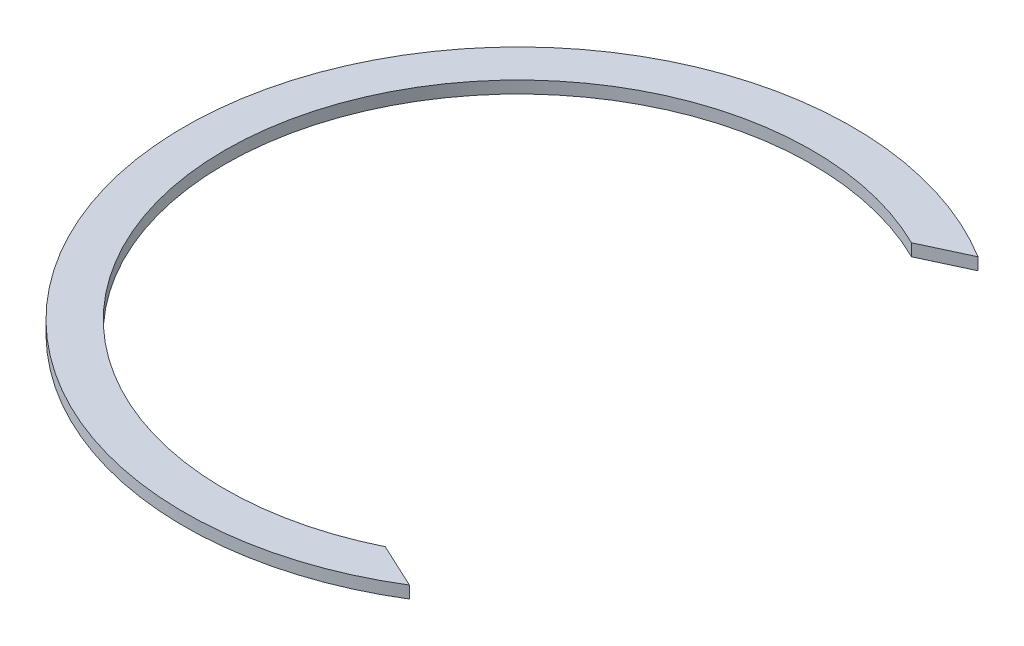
from build123d import *

# Parameters (mm, degrees)
SKETCH_1_R           = 16.5
SKETCH_1_R_2         = 14
EXTRUDE_1_DEPTH      = 0.6
SKETCH_5_R           = 14.5
CUT_EXTRUDE_2_DEPTH  = 24.342236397
EXTRUDE_4_DEPTH      = 0.6
SKETCH_14_W          = 15.277273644
SKETCH_14_H          = 26
CUT_EXTRUDE_8_DEPTH  = 24.342236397
SKETCH_15_W          = 11.969718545
SKETCH_15_H          = 26.54882295
CUT_EXTRUDE_9_DEPTH  = 24.342236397
CUT_EXTRUDE_11_DEPTH = 24.342236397


with BuildPart() as part:
    # Sketch 1 → Extrude 1 (new body)
    with BuildSketch(Plane(origin=(0, 0, 0), x_dir=(1, 0, 0), z_dir=(0, 1, 0))):
        with Locations(Location((0, 0, 0), (0, 0, 270))):
            Circle(SKETCH_1_R)
        with Locations(Location((0, 0, 0), (0, 0, 270))):
            Circle(SKETCH_1_R_2, mode=Mode.SUBTRACT)
    extrude(amount=EXTRUDE_1_DEPTH)

    # Sketch 5 → Cut-Extrude 2 (cut, through all)
    with BuildSketch(Plane(origin=(0, 0.6, 0), x_dir=(1, 0, 0), z_dir=(0, 1, 0))):
        with Locations(Location((0, 0, 0), (0, 0, 270))):
            Circle(SKETCH_5_R)
    extrude(amount=-CUT_EXTRUDE_2_DEPTH, mode=Mode.SUBTRACT)

    # Sketch 3 → Extrude 4 (add)
    with BuildSketch(Plane(origin=(0, 0.6, 0), x_dir=(1, 0, 0), z_dir=(0, 1, 0))):
        with BuildLine():
            Line((-14.422205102, 1.5), (-15.025311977, 1.5))
            ThreePointArc((-15.025311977, 1.5), (-15.1, 0), (-15.025311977, -1.5))
            Line((-15.025311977, -1.5), (-14.422205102, -1.5))
            ThreePointArc((-14.422205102, -1.5), (-14.5, 0), (-14.422205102, 1.5))
        make_face()
    extrude(amount=-EXTRUDE_4_DEPTH)

    # Sketch 14 → Cut-Extrude 8 (cut, through all)
    with BuildSketch(Plane(origin=(0, 0.6, 0), x_dir=(1, 0, 0), z_dir=(0, 1, 0))):
        with Locations((14.061253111, 0)):
            Rectangle(SKETCH_14_W, SKETCH_14_H)
    extrude(amount=-CUT_EXTRUDE_8_DEPTH, mode=Mode.SUBTRACT)

    # Sketch 15 → Cut-Extrude 9 (cut, through all)
    with BuildSketch(Plane(origin=(0, 0.6, 0), x_dir=(1, 0, 0), z_dir=(0, 1, 0))):
        with Locations((15.784859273, 0)):
            Rectangle(SKETCH_15_W, SKETCH_15_H)
    extrude(amount=-CUT_EXTRUDE_9_DEPTH, mode=Mode.SUBTRACT)

    # Sketch 17 → Cut-Extrude 11 (cut, through all)
    with BuildSketch(Plane(origin=(0, 0.6, 0), x_dir=(1, 0, 0), z_dir=(0, 1, 0))):
        Polygon((6.422616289, 13), (11.323195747, 15.285177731), (11.323195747, 13), align=None)
        Polygon((11.323195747, -15.285177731), (11.323195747, -13), (6.422616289, -13), align=None)
    extrude(amount=-CUT_EXTRUDE_11_DEPTH, mode=Mode.SUBTRACT)


solid = part.part
